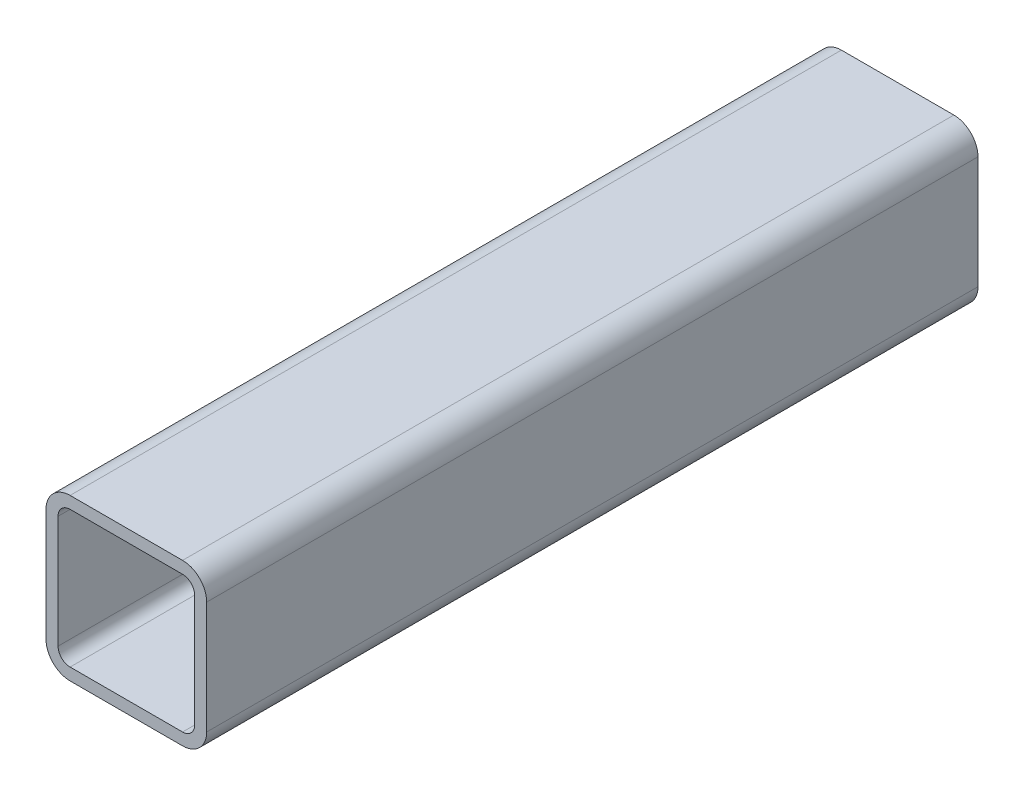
ISO-10303-21;
HEADER;
FILE_DESCRIPTION(('STEP AP214'),'2;1');
FILE_NAME('part.step','',(''),(''),'','','');
FILE_SCHEMA(('AUTOMOTIVE_DESIGN { 1 0 10303 214 1 1 1 1 }'));
ENDSEC;
DATA;
#1=APPLICATION_CONTEXT('core data for automotive mechanical design processes');
#2=APPLICATION_PROTOCOL_DEFINITION('international standard','automotive_design',2000,#1);
#3=PRODUCT_CONTEXT('',#1,'mechanical');
#4=PRODUCT('Part','Part','',(#3));
#5=PRODUCT_RELATED_PRODUCT_CATEGORY('part','',(#4));
#6=PRODUCT_DEFINITION_FORMATION('','',#4);
#7=PRODUCT_DEFINITION_CONTEXT('part definition',#1,'design');
#8=PRODUCT_DEFINITION('design','',#6,#7);
#9=PRODUCT_DEFINITION_SHAPE('','',#8);
#10=(LENGTH_UNIT() NAMED_UNIT(*) SI_UNIT(.MILLI.,.METRE.));
#11=(NAMED_UNIT(*) PLANE_ANGLE_UNIT() SI_UNIT($,.RADIAN.));
#12=(NAMED_UNIT(*) SI_UNIT($,.STERADIAN.) SOLID_ANGLE_UNIT());
#13=UNCERTAINTY_MEASURE_WITH_UNIT(LENGTH_MEASURE(1.E-05),#10,'distance_accuracy_value','');
#14=(GEOMETRIC_REPRESENTATION_CONTEXT(3) GLOBAL_UNCERTAINTY_ASSIGNED_CONTEXT((#13)) GLOBAL_UNIT_ASSIGNED_CONTEXT((#10,
#11,#12)) REPRESENTATION_CONTEXT('',''));
#15=CARTESIAN_POINT('',(0.,0.,0.));
#16=DIRECTION('',(0.,0.,1.));
#17=DIRECTION('',(1.,0.,0.));
#18=AXIS2_PLACEMENT_3D('',#15,#16,#17);
#19=CARTESIAN_POINT('',(12.4210851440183,54.799418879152,304.8));
#20=DIRECTION('',(0.,0.,1.));
#21=DIRECTION('',(1.,0.,0.));
#22=AXIS2_PLACEMENT_3D('',#19,#20,#21);
#23=PLANE('',#22);
#24=CARTESIAN_POINT('',(12.4210851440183,54.799418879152,304.8));
#25=DIRECTION('',(0.,0.,1.));
#26=DIRECTION('',(1.,0.,0.));
#27=AXIS2_PLACEMENT_3D('',#24,#25,#26);
#28=CIRCLE('',#27,9.52500000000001);
#29=CARTESIAN_POINT('',(12.4210851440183,64.324418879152,304.8));
#30=VERTEX_POINT('',#29);
#31=CARTESIAN_POINT('',(2.89608514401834,54.799418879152,304.8));
#32=VERTEX_POINT('',#31);
#33=EDGE_CURVE('E211',#30,#32,#28,.T.);
#34=ORIENTED_EDGE('',*,*,#33,.T.);
#35=DIRECTION('',(0.,-1.,0.));
#36=VECTOR('',#35,1.);
#37=CARTESIAN_POINT('',(2.89608514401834,10.349418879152,304.8));
#38=LINE('',#37,#36);
#39=CARTESIAN_POINT('',(2.89608514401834,10.349418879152,304.8));
#40=VERTEX_POINT('',#39);
#41=EDGE_CURVE('E214',#32,#40,#38,.T.);
#42=ORIENTED_EDGE('',*,*,#41,.T.);
#43=CARTESIAN_POINT('',(12.4210851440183,10.349418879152,304.8));
#44=DIRECTION('',(0.,0.,1.));
#45=DIRECTION('',(1.,0.,0.));
#46=AXIS2_PLACEMENT_3D('',#43,#44,#45);
#47=CIRCLE('',#46,9.525);
#48=CARTESIAN_POINT('',(12.4210851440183,0.824418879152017,304.8));
#49=VERTEX_POINT('',#48);
#50=EDGE_CURVE('E217',#40,#49,#47,.T.);
#51=ORIENTED_EDGE('',*,*,#50,.T.);
#52=DIRECTION('',(1.,0.,0.));
#53=VECTOR('',#52,1.);
#54=CARTESIAN_POINT('',(56.8710851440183,0.824418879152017,304.8));
#55=LINE('',#54,#53);
#56=CARTESIAN_POINT('',(56.8710851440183,0.824418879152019,304.8));
#57=VERTEX_POINT('',#56);
#58=EDGE_CURVE('E219',#49,#57,#55,.T.);
#59=ORIENTED_EDGE('',*,*,#58,.T.);
#60=CARTESIAN_POINT('',(56.8710851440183,10.349418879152,304.8));
#61=DIRECTION('',(0.,0.,1.));
#62=DIRECTION('',(1.,0.,0.));
#63=AXIS2_PLACEMENT_3D('',#60,#61,#62);
#64=CIRCLE('',#63,9.525);
#65=CARTESIAN_POINT('',(66.3960851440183,10.349418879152,304.8));
#66=VERTEX_POINT('',#65);
#67=EDGE_CURVE('E221',#57,#66,#64,.T.);
#68=ORIENTED_EDGE('',*,*,#67,.T.);
#69=DIRECTION('',(0.,1.,0.));
#70=VECTOR('',#69,1.);
#71=CARTESIAN_POINT('',(66.3960851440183,54.799418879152,304.8));
#72=LINE('',#71,#70);
#73=CARTESIAN_POINT('',(66.3960851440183,54.799418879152,304.8));
#74=VERTEX_POINT('',#73);
#75=EDGE_CURVE('E223',#66,#74,#72,.T.);
#76=ORIENTED_EDGE('',*,*,#75,.T.);
#77=CARTESIAN_POINT('',(56.8710851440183,54.799418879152,304.8));
#78=DIRECTION('',(0.,0.,1.));
#79=DIRECTION('',(1.,0.,0.));
#80=AXIS2_PLACEMENT_3D('',#77,#78,#79);
#81=CIRCLE('',#80,9.52500000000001);
#82=CARTESIAN_POINT('',(56.8710851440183,64.324418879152,304.8));
#83=VERTEX_POINT('',#82);
#84=EDGE_CURVE('E225',#74,#83,#81,.T.);
#85=ORIENTED_EDGE('',*,*,#84,.T.);
#86=DIRECTION('',(-1.,0.,0.));
#87=VECTOR('',#86,1.);
#88=CARTESIAN_POINT('',(12.4210851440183,64.324418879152,304.8));
#89=LINE('',#88,#87);
#90=EDGE_CURVE('E227',#83,#30,#89,.T.);
#91=ORIENTED_EDGE('',*,*,#90,.T.);
#92=EDGE_LOOP('',(#34,#42,#51,#59,#68,#76,#85,#91));
#93=FACE_BOUND('',#92,.T.);
#94=DIRECTION('',(0.,-1.,0.));
#95=VECTOR('',#94,1.);
#96=CARTESIAN_POINT('',(7.65858514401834,10.349418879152,304.8));
#97=LINE('',#96,#95);
#98=CARTESIAN_POINT('',(7.65858514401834,54.799418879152,304.8));
#99=VERTEX_POINT('',#98);
#100=CARTESIAN_POINT('',(7.65858514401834,10.349418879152,304.8));
#101=VERTEX_POINT('',#100);
#102=EDGE_CURVE('E154',#99,#101,#97,.T.);
#103=ORIENTED_EDGE('',*,*,#102,.F.);
#104=CARTESIAN_POINT('',(12.4210851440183,54.799418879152,304.8));
#105=DIRECTION('',(0.,0.,1.));
#106=DIRECTION('',(1.,0.,0.));
#107=AXIS2_PLACEMENT_3D('',#104,#105,#106);
#108=CIRCLE('',#107,4.7625);
#109=CARTESIAN_POINT('',(12.4210851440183,59.561918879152,304.8));
#110=VERTEX_POINT('',#109);
#111=EDGE_CURVE('E146',#110,#99,#108,.T.);
#112=ORIENTED_EDGE('',*,*,#111,.F.);
#113=DIRECTION('',(-1.,0.,0.));
#114=VECTOR('',#113,1.);
#115=CARTESIAN_POINT('',(12.4210851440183,59.561918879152,304.8));
#116=LINE('',#115,#114);
#117=CARTESIAN_POINT('',(56.8710851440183,59.561918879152,304.8));
#118=VERTEX_POINT('',#117);
#119=EDGE_CURVE('E179',#118,#110,#116,.T.);
#120=ORIENTED_EDGE('',*,*,#119,.F.);
#121=CARTESIAN_POINT('',(56.8710851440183,54.799418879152,304.8));
#122=DIRECTION('',(0.,0.,1.));
#123=DIRECTION('',(1.,0.,0.));
#124=AXIS2_PLACEMENT_3D('',#121,#122,#123);
#125=CIRCLE('',#124,4.76250000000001);
#126=CARTESIAN_POINT('',(61.6335851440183,54.799418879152,304.8));
#127=VERTEX_POINT('',#126);
#128=EDGE_CURVE('E177',#127,#118,#125,.T.);
#129=ORIENTED_EDGE('',*,*,#128,.F.);
#130=DIRECTION('',(0.,1.,0.));
#131=VECTOR('',#130,1.);
#132=CARTESIAN_POINT('',(61.6335851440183,54.799418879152,304.8));
#133=LINE('',#132,#131);
#134=CARTESIAN_POINT('',(61.6335851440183,10.349418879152,304.8));
#135=VERTEX_POINT('',#134);
#136=EDGE_CURVE('E175',#135,#127,#133,.T.);
#137=ORIENTED_EDGE('',*,*,#136,.F.);
#138=CARTESIAN_POINT('',(56.8710851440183,10.349418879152,304.8));
#139=DIRECTION('',(0.,0.,1.));
#140=DIRECTION('',(1.,0.,0.));
#141=AXIS2_PLACEMENT_3D('',#138,#139,#140);
#142=CIRCLE('',#141,4.7625);
#143=CARTESIAN_POINT('',(56.8710851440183,5.58691887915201,304.8));
#144=VERTEX_POINT('',#143);
#145=EDGE_CURVE('E173',#144,#135,#142,.T.);
#146=ORIENTED_EDGE('',*,*,#145,.F.);
#147=DIRECTION('',(1.,0.,0.));
#148=VECTOR('',#147,1.);
#149=CARTESIAN_POINT('',(56.8710851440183,5.58691887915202,304.8));
#150=LINE('',#149,#148);
#151=CARTESIAN_POINT('',(12.4210851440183,5.58691887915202,304.8));
#152=VERTEX_POINT('',#151);
#153=EDGE_CURVE('E169',#152,#144,#150,.T.);
#154=ORIENTED_EDGE('',*,*,#153,.F.);
#155=CARTESIAN_POINT('',(12.4210851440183,10.349418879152,304.8));
#156=DIRECTION('',(0.,0.,1.));
#157=DIRECTION('',(1.,0.,0.));
#158=AXIS2_PLACEMENT_3D('',#155,#156,#157);
#159=CIRCLE('',#158,4.7625);
#160=EDGE_CURVE('E167',#101,#152,#159,.T.);
#161=ORIENTED_EDGE('',*,*,#160,.F.);
#162=EDGE_LOOP('',(#103,#112,#120,#129,#137,#146,#154,#161));
#163=FACE_BOUND('',#162,.T.);
#164=ADVANCED_FACE('F33',(#93,#163),#23,.T.);
#165=CARTESIAN_POINT('',(12.4210851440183,54.799418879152,0.));
#166=DIRECTION('',(0.,0.,1.));
#167=DIRECTION('',(1.,0.,0.));
#168=AXIS2_PLACEMENT_3D('',#165,#166,#167);
#169=PLANE('',#168);
#170=CARTESIAN_POINT('',(12.4210851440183,54.799418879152,0.));
#171=DIRECTION('',(0.,0.,1.));
#172=DIRECTION('',(1.,0.,0.));
#173=AXIS2_PLACEMENT_3D('',#170,#171,#172);
#174=CIRCLE('',#173,9.52500000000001);
#175=CARTESIAN_POINT('',(12.4210851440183,64.324418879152,0.));
#176=VERTEX_POINT('',#175);
#177=CARTESIAN_POINT('',(2.89608514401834,54.799418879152,0.));
#178=VERTEX_POINT('',#177);
#179=EDGE_CURVE('E162',#176,#178,#174,.T.);
#180=ORIENTED_EDGE('',*,*,#179,.F.);
#181=DIRECTION('',(-1.,0.,0.));
#182=VECTOR('',#181,1.);
#183=CARTESIAN_POINT('',(12.4210851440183,64.324418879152,0.));
#184=LINE('',#183,#182);
#185=CARTESIAN_POINT('',(56.8710851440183,64.324418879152,0.));
#186=VERTEX_POINT('',#185);
#187=EDGE_CURVE('E215',#186,#176,#184,.T.);
#188=ORIENTED_EDGE('',*,*,#187,.F.);
#189=CARTESIAN_POINT('',(56.8710851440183,54.799418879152,0.));
#190=DIRECTION('',(0.,0.,1.));
#191=DIRECTION('',(1.,0.,0.));
#192=AXIS2_PLACEMENT_3D('',#189,#190,#191);
#193=CIRCLE('',#192,9.52500000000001);
#194=CARTESIAN_POINT('',(66.3960851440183,54.799418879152,0.));
#195=VERTEX_POINT('',#194);
#196=EDGE_CURVE('E242',#195,#186,#193,.T.);
#197=ORIENTED_EDGE('',*,*,#196,.F.);
#198=DIRECTION('',(0.,1.,0.));
#199=VECTOR('',#198,1.);
#200=CARTESIAN_POINT('',(66.3960851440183,54.799418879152,0.));
#201=LINE('',#200,#199);
#202=CARTESIAN_POINT('',(66.3960851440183,10.349418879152,0.));
#203=VERTEX_POINT('',#202);
#204=EDGE_CURVE('E240',#203,#195,#201,.T.);
#205=ORIENTED_EDGE('',*,*,#204,.F.);
#206=CARTESIAN_POINT('',(56.8710851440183,10.349418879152,0.));
#207=DIRECTION('',(0.,0.,1.));
#208=DIRECTION('',(1.,0.,0.));
#209=AXIS2_PLACEMENT_3D('',#206,#207,#208);
#210=CIRCLE('',#209,9.525);
#211=CARTESIAN_POINT('',(56.8710851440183,0.824418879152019,0.));
#212=VERTEX_POINT('',#211);
#213=EDGE_CURVE('E238',#212,#203,#210,.T.);
#214=ORIENTED_EDGE('',*,*,#213,.F.);
#215=DIRECTION('',(1.,0.,0.));
#216=VECTOR('',#215,1.);
#217=CARTESIAN_POINT('',(56.8710851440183,0.824418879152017,0.));
#218=LINE('',#217,#216);
#219=CARTESIAN_POINT('',(12.4210851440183,0.824418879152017,0.));
#220=VERTEX_POINT('',#219);
#221=EDGE_CURVE('E236',#220,#212,#218,.T.);
#222=ORIENTED_EDGE('',*,*,#221,.F.);
#223=CARTESIAN_POINT('',(12.4210851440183,10.349418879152,0.));
#224=DIRECTION('',(0.,0.,1.));
#225=DIRECTION('',(1.,0.,0.));
#226=AXIS2_PLACEMENT_3D('',#223,#224,#225);
#227=CIRCLE('',#226,9.525);
#228=CARTESIAN_POINT('',(2.89608514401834,10.349418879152,0.));
#229=VERTEX_POINT('',#228);
#230=EDGE_CURVE('E234',#229,#220,#227,.T.);
#231=ORIENTED_EDGE('',*,*,#230,.F.);
#232=DIRECTION('',(0.,-1.,0.));
#233=VECTOR('',#232,1.);
#234=CARTESIAN_POINT('',(2.89608514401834,10.349418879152,0.));
#235=LINE('',#234,#233);
#236=EDGE_CURVE('E232',#178,#229,#235,.T.);
#237=ORIENTED_EDGE('',*,*,#236,.F.);
#238=EDGE_LOOP('',(#180,#188,#197,#205,#214,#222,#231,#237));
#239=FACE_BOUND('',#238,.T.);
#240=CARTESIAN_POINT('',(12.4210851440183,54.799418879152,0.));
#241=DIRECTION('',(0.,0.,1.));
#242=DIRECTION('',(1.,0.,0.));
#243=AXIS2_PLACEMENT_3D('',#240,#241,#242);
#244=CIRCLE('',#243,4.7625);
#245=CARTESIAN_POINT('',(12.4210851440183,59.561918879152,0.));
#246=VERTEX_POINT('',#245);
#247=CARTESIAN_POINT('',(7.65858514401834,54.799418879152,0.));
#248=VERTEX_POINT('',#247);
#249=EDGE_CURVE('E56',#246,#248,#244,.T.);
#250=ORIENTED_EDGE('',*,*,#249,.T.);
#251=DIRECTION('',(0.,-1.,0.));
#252=VECTOR('',#251,1.);
#253=CARTESIAN_POINT('',(7.65858514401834,10.349418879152,0.));
#254=LINE('',#253,#252);
#255=CARTESIAN_POINT('',(7.65858514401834,10.349418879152,0.));
#256=VERTEX_POINT('',#255);
#257=EDGE_CURVE('E161',#248,#256,#254,.T.);
#258=ORIENTED_EDGE('',*,*,#257,.T.);
#259=CARTESIAN_POINT('',(12.4210851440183,10.349418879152,0.));
#260=DIRECTION('',(0.,0.,1.));
#261=DIRECTION('',(1.,0.,0.));
#262=AXIS2_PLACEMENT_3D('',#259,#260,#261);
#263=CIRCLE('',#262,4.7625);
#264=CARTESIAN_POINT('',(12.4210851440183,5.58691887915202,0.));
#265=VERTEX_POINT('',#264);
#266=EDGE_CURVE('E183',#256,#265,#263,.T.);
#267=ORIENTED_EDGE('',*,*,#266,.T.);
#268=DIRECTION('',(1.,0.,0.));
#269=VECTOR('',#268,1.);
#270=CARTESIAN_POINT('',(56.8710851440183,5.58691887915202,0.));
#271=LINE('',#270,#269);
#272=CARTESIAN_POINT('',(56.8710851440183,5.58691887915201,0.));
#273=VERTEX_POINT('',#272);
#274=EDGE_CURVE('E186',#265,#273,#271,.T.);
#275=ORIENTED_EDGE('',*,*,#274,.T.);
#276=CARTESIAN_POINT('',(56.8710851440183,10.349418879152,0.));
#277=DIRECTION('',(0.,0.,1.));
#278=DIRECTION('',(1.,0.,0.));
#279=AXIS2_PLACEMENT_3D('',#276,#277,#278);
#280=CIRCLE('',#279,4.7625);
#281=CARTESIAN_POINT('',(61.6335851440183,10.349418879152,0.));
#282=VERTEX_POINT('',#281);
#283=EDGE_CURVE('E189',#273,#282,#280,.T.);
#284=ORIENTED_EDGE('',*,*,#283,.T.);
#285=DIRECTION('',(0.,1.,0.));
#286=VECTOR('',#285,1.);
#287=CARTESIAN_POINT('',(61.6335851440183,54.799418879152,0.));
#288=LINE('',#287,#286);
#289=CARTESIAN_POINT('',(61.6335851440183,54.799418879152,0.));
#290=VERTEX_POINT('',#289);
#291=EDGE_CURVE('E192',#282,#290,#288,.T.);
#292=ORIENTED_EDGE('',*,*,#291,.T.);
#293=CARTESIAN_POINT('',(56.8710851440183,54.799418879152,0.));
#294=DIRECTION('',(0.,0.,1.));
#295=DIRECTION('',(1.,0.,0.));
#296=AXIS2_PLACEMENT_3D('',#293,#294,#295);
#297=CIRCLE('',#296,4.76250000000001);
#298=CARTESIAN_POINT('',(56.8710851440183,59.561918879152,0.));
#299=VERTEX_POINT('',#298);
#300=EDGE_CURVE('E195',#290,#299,#297,.T.);
#301=ORIENTED_EDGE('',*,*,#300,.T.);
#302=DIRECTION('',(-1.,0.,0.));
#303=VECTOR('',#302,1.);
#304=CARTESIAN_POINT('',(12.4210851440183,59.561918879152,0.));
#305=LINE('',#304,#303);
#306=EDGE_CURVE('E155',#299,#246,#305,.T.);
#307=ORIENTED_EDGE('',*,*,#306,.T.);
#308=EDGE_LOOP('',(#250,#258,#267,#275,#284,#292,#301,#307));
#309=FACE_BOUND('',#308,.T.);
#310=ADVANCED_FACE('F272',(#239,#309),#169,.F.);
#311=CARTESIAN_POINT('',(12.4210851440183,54.799418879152,304.8));
#312=DIRECTION('',(0.,0.,-1.));
#313=DIRECTION('',(-1.,0.,0.));
#314=AXIS2_PLACEMENT_3D('',#311,#312,#313);
#315=CYLINDRICAL_SURFACE('',#314,9.52500000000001);
#316=ORIENTED_EDGE('',*,*,#179,.T.);
#317=DIRECTION('',(0.,0.,-1.));
#318=VECTOR('',#317,1.);
#319=CARTESIAN_POINT('',(2.89608514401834,54.799418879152,304.8));
#320=LINE('',#319,#318);
#321=EDGE_CURVE('E11',#32,#178,#320,.T.);
#322=ORIENTED_EDGE('',*,*,#321,.F.);
#323=ORIENTED_EDGE('',*,*,#33,.F.);
#324=DIRECTION('',(0.,0.,-1.));
#325=VECTOR('',#324,1.);
#326=CARTESIAN_POINT('',(12.4210851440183,64.324418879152,304.8));
#327=LINE('',#326,#325);
#328=EDGE_CURVE('E229',#30,#176,#327,.T.);
#329=ORIENTED_EDGE('',*,*,#328,.T.);
#330=EDGE_LOOP('',(#316,#322,#323,#329));
#331=FACE_BOUND('',#330,.T.);
#332=ADVANCED_FACE('F35',(#331),#315,.T.);
#333=CARTESIAN_POINT('',(2.89608514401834,10.349418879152,304.8));
#334=DIRECTION('',(1.,0.,0.));
#335=DIRECTION('',(0.,0.,-1.));
#336=AXIS2_PLACEMENT_3D('',#333,#334,#335);
#337=PLANE('',#336);
#338=ORIENTED_EDGE('',*,*,#236,.T.);
#339=DIRECTION('',(0.,0.,-1.));
#340=VECTOR('',#339,1.);
#341=CARTESIAN_POINT('',(2.89608514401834,10.349418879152,304.8));
#342=LINE('',#341,#340);
#343=EDGE_CURVE('E41',#40,#229,#342,.T.);
#344=ORIENTED_EDGE('',*,*,#343,.F.);
#345=ORIENTED_EDGE('',*,*,#41,.F.);
#346=ORIENTED_EDGE('',*,*,#321,.T.);
#347=EDGE_LOOP('',(#338,#344,#345,#346));
#348=FACE_BOUND('',#347,.T.);
#349=ADVANCED_FACE('F289',(#348),#337,.F.);
#350=CARTESIAN_POINT('',(12.4210851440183,10.349418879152,304.8));
#351=DIRECTION('',(0.,0.,-1.));
#352=DIRECTION('',(-1.,0.,0.));
#353=AXIS2_PLACEMENT_3D('',#350,#351,#352);
#354=CYLINDRICAL_SURFACE('',#353,9.525);
#355=ORIENTED_EDGE('',*,*,#230,.T.);
#356=DIRECTION('',(0.,0.,-1.));
#357=VECTOR('',#356,1.);
#358=CARTESIAN_POINT('',(12.4210851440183,0.824418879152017,304.8));
#359=LINE('',#358,#357);
#360=EDGE_CURVE('E259',#49,#220,#359,.T.);
#361=ORIENTED_EDGE('',*,*,#360,.F.);
#362=ORIENTED_EDGE('',*,*,#50,.F.);
#363=ORIENTED_EDGE('',*,*,#343,.T.);
#364=EDGE_LOOP('',(#355,#361,#362,#363));
#365=FACE_BOUND('',#364,.T.);
#366=ADVANCED_FACE('F266',(#365),#354,.T.);
#367=CARTESIAN_POINT('',(56.8710851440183,0.824418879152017,304.8));
#368=DIRECTION('',(0.,1.,0.));
#369=DIRECTION('',(0.,0.,1.));
#370=AXIS2_PLACEMENT_3D('',#367,#368,#369);
#371=PLANE('',#370);
#372=ORIENTED_EDGE('',*,*,#221,.T.);
#373=DIRECTION('',(0.,0.,-1.));
#374=VECTOR('',#373,1.);
#375=CARTESIAN_POINT('',(56.8710851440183,0.824418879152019,304.8));
#376=LINE('',#375,#374);
#377=EDGE_CURVE('E256',#57,#212,#376,.T.);
#378=ORIENTED_EDGE('',*,*,#377,.F.);
#379=ORIENTED_EDGE('',*,*,#58,.F.);
#380=ORIENTED_EDGE('',*,*,#360,.T.);
#381=EDGE_LOOP('',(#372,#378,#379,#380));
#382=FACE_BOUND('',#381,.T.);
#383=ADVANCED_FACE('F278',(#382),#371,.F.);
#384=CARTESIAN_POINT('',(56.8710851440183,10.349418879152,304.8));
#385=DIRECTION('',(0.,0.,-1.));
#386=DIRECTION('',(-1.,0.,0.));
#387=AXIS2_PLACEMENT_3D('',#384,#385,#386);
#388=CYLINDRICAL_SURFACE('',#387,9.525);
#389=ORIENTED_EDGE('',*,*,#213,.T.);
#390=DIRECTION('',(0.,0.,-1.));
#391=VECTOR('',#390,1.);
#392=CARTESIAN_POINT('',(66.3960851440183,10.349418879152,304.8));
#393=LINE('',#392,#391);
#394=EDGE_CURVE('E253',#66,#203,#393,.T.);
#395=ORIENTED_EDGE('',*,*,#394,.F.);
#396=ORIENTED_EDGE('',*,*,#67,.F.);
#397=ORIENTED_EDGE('',*,*,#377,.T.);
#398=EDGE_LOOP('',(#389,#395,#396,#397));
#399=FACE_BOUND('',#398,.T.);
#400=ADVANCED_FACE('F282',(#399),#388,.T.);
#401=CARTESIAN_POINT('',(66.3960851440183,54.799418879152,304.8));
#402=DIRECTION('',(-1.,0.,0.));
#403=DIRECTION('',(0.,0.,1.));
#404=AXIS2_PLACEMENT_3D('',#401,#402,#403);
#405=PLANE('',#404);
#406=ORIENTED_EDGE('',*,*,#204,.T.);
#407=DIRECTION('',(0.,0.,-1.));
#408=VECTOR('',#407,1.);
#409=CARTESIAN_POINT('',(66.3960851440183,54.799418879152,304.8));
#410=LINE('',#409,#408);
#411=EDGE_CURVE('E250',#74,#195,#410,.T.);
#412=ORIENTED_EDGE('',*,*,#411,.F.);
#413=ORIENTED_EDGE('',*,*,#75,.F.);
#414=ORIENTED_EDGE('',*,*,#394,.T.);
#415=EDGE_LOOP('',(#406,#412,#413,#414));
#416=FACE_BOUND('',#415,.T.);
#417=ADVANCED_FACE('F302',(#416),#405,.F.);
#418=CARTESIAN_POINT('',(56.8710851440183,54.799418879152,304.8));
#419=DIRECTION('',(0.,0.,-1.));
#420=DIRECTION('',(-1.,0.,0.));
#421=AXIS2_PLACEMENT_3D('',#418,#419,#420);
#422=CYLINDRICAL_SURFACE('',#421,9.52500000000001);
#423=ORIENTED_EDGE('',*,*,#196,.T.);
#424=DIRECTION('',(0.,0.,-1.));
#425=VECTOR('',#424,1.);
#426=CARTESIAN_POINT('',(56.8710851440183,64.324418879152,304.8));
#427=LINE('',#426,#425);
#428=EDGE_CURVE('E247',#83,#186,#427,.T.);
#429=ORIENTED_EDGE('',*,*,#428,.F.);
#430=ORIENTED_EDGE('',*,*,#84,.F.);
#431=ORIENTED_EDGE('',*,*,#411,.T.);
#432=EDGE_LOOP('',(#423,#429,#430,#431));
#433=FACE_BOUND('',#432,.T.);
#434=ADVANCED_FACE('F300',(#433),#422,.T.);
#435=CARTESIAN_POINT('',(12.4210851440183,64.324418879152,304.8));
#436=DIRECTION('',(0.,-1.,0.));
#437=DIRECTION('',(0.,0.,-1.));
#438=AXIS2_PLACEMENT_3D('',#435,#436,#437);
#439=PLANE('',#438);
#440=ORIENTED_EDGE('',*,*,#187,.T.);
#441=ORIENTED_EDGE('',*,*,#328,.F.);
#442=ORIENTED_EDGE('',*,*,#90,.F.);
#443=ORIENTED_EDGE('',*,*,#428,.T.);
#444=EDGE_LOOP('',(#440,#441,#442,#443));
#445=FACE_BOUND('',#444,.T.);
#446=ADVANCED_FACE('F295',(#445),#439,.F.);
#447=CARTESIAN_POINT('',(12.4210851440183,54.799418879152,304.8));
#448=DIRECTION('',(0.,0.,-1.));
#449=DIRECTION('',(-1.,0.,0.));
#450=AXIS2_PLACEMENT_3D('',#447,#448,#449);
#451=CYLINDRICAL_SURFACE('',#450,4.7625);
#452=ORIENTED_EDGE('',*,*,#249,.F.);
#453=DIRECTION('',(0.,0.,-1.));
#454=VECTOR('',#453,1.);
#455=CARTESIAN_POINT('',(12.4210851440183,59.561918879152,304.8));
#456=LINE('',#455,#454);
#457=EDGE_CURVE('E150',#110,#246,#456,.T.);
#458=ORIENTED_EDGE('',*,*,#457,.F.);
#459=ORIENTED_EDGE('',*,*,#111,.T.);
#460=DIRECTION('',(0.,0.,-1.));
#461=VECTOR('',#460,1.);
#462=CARTESIAN_POINT('',(7.65858514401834,54.799418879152,304.8));
#463=LINE('',#462,#461);
#464=EDGE_CURVE('E149',#99,#248,#463,.T.);
#465=ORIENTED_EDGE('',*,*,#464,.T.);
#466=EDGE_LOOP('',(#452,#458,#459,#465));
#467=FACE_BOUND('',#466,.T.);
#468=ADVANCED_FACE('F148',(#467),#451,.F.);
#469=CARTESIAN_POINT('',(7.65858514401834,10.349418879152,304.8));
#470=DIRECTION('',(1.,0.,0.));
#471=DIRECTION('',(0.,0.,-1.));
#472=AXIS2_PLACEMENT_3D('',#469,#470,#471);
#473=PLANE('',#472);
#474=ORIENTED_EDGE('',*,*,#257,.F.);
#475=ORIENTED_EDGE('',*,*,#464,.F.);
#476=ORIENTED_EDGE('',*,*,#102,.T.);
#477=DIRECTION('',(0.,0.,-1.));
#478=VECTOR('',#477,1.);
#479=CARTESIAN_POINT('',(7.65858514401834,10.349418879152,304.8));
#480=LINE('',#479,#478);
#481=EDGE_CURVE('E163',#101,#256,#480,.T.);
#482=ORIENTED_EDGE('',*,*,#481,.T.);
#483=EDGE_LOOP('',(#474,#475,#476,#482));
#484=FACE_BOUND('',#483,.T.);
#485=ADVANCED_FACE('F158',(#484),#473,.T.);
#486=CARTESIAN_POINT('',(12.4210851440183,10.349418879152,304.8));
#487=DIRECTION('',(0.,0.,-1.));
#488=DIRECTION('',(-1.,0.,0.));
#489=AXIS2_PLACEMENT_3D('',#486,#487,#488);
#490=CYLINDRICAL_SURFACE('',#489,4.7625);
#491=ORIENTED_EDGE('',*,*,#266,.F.);
#492=ORIENTED_EDGE('',*,*,#481,.F.);
#493=ORIENTED_EDGE('',*,*,#160,.T.);
#494=DIRECTION('',(0.,0.,-1.));
#495=VECTOR('',#494,1.);
#496=CARTESIAN_POINT('',(12.4210851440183,5.58691887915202,304.8));
#497=LINE('',#496,#495);
#498=EDGE_CURVE('E208',#152,#265,#497,.T.);
#499=ORIENTED_EDGE('',*,*,#498,.T.);
#500=EDGE_LOOP('',(#491,#492,#493,#499));
#501=FACE_BOUND('',#500,.T.);
#502=ADVANCED_FACE('F327',(#501),#490,.F.);
#503=CARTESIAN_POINT('',(56.8710851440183,5.58691887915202,304.8));
#504=DIRECTION('',(0.,1.,0.));
#505=DIRECTION('',(0.,0.,1.));
#506=AXIS2_PLACEMENT_3D('',#503,#504,#505);
#507=PLANE('',#506);
#508=ORIENTED_EDGE('',*,*,#274,.F.);
#509=ORIENTED_EDGE('',*,*,#498,.F.);
#510=ORIENTED_EDGE('',*,*,#153,.T.);
#511=DIRECTION('',(0.,0.,-1.));
#512=VECTOR('',#511,1.);
#513=CARTESIAN_POINT('',(56.8710851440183,5.58691887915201,304.8));
#514=LINE('',#513,#512);
#515=EDGE_CURVE('E206',#144,#273,#514,.T.);
#516=ORIENTED_EDGE('',*,*,#515,.T.);
#517=EDGE_LOOP('',(#508,#509,#510,#516));
#518=FACE_BOUND('',#517,.T.);
#519=ADVANCED_FACE('F331',(#518),#507,.T.);
#520=CARTESIAN_POINT('',(56.8710851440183,10.349418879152,304.8));
#521=DIRECTION('',(0.,0.,-1.));
#522=DIRECTION('',(-1.,0.,0.));
#523=AXIS2_PLACEMENT_3D('',#520,#521,#522);
#524=CYLINDRICAL_SURFACE('',#523,4.7625);
#525=ORIENTED_EDGE('',*,*,#283,.F.);
#526=ORIENTED_EDGE('',*,*,#515,.F.);
#527=ORIENTED_EDGE('',*,*,#145,.T.);
#528=DIRECTION('',(0.,0.,-1.));
#529=VECTOR('',#528,1.);
#530=CARTESIAN_POINT('',(61.6335851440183,10.349418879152,304.8));
#531=LINE('',#530,#529);
#532=EDGE_CURVE('E204',#135,#282,#531,.T.);
#533=ORIENTED_EDGE('',*,*,#532,.T.);
#534=EDGE_LOOP('',(#525,#526,#527,#533));
#535=FACE_BOUND('',#534,.T.);
#536=ADVANCED_FACE('F337',(#535),#524,.F.);
#537=CARTESIAN_POINT('',(61.6335851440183,54.799418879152,304.8));
#538=DIRECTION('',(-1.,0.,0.));
#539=DIRECTION('',(0.,0.,1.));
#540=AXIS2_PLACEMENT_3D('',#537,#538,#539);
#541=PLANE('',#540);
#542=ORIENTED_EDGE('',*,*,#291,.F.);
#543=ORIENTED_EDGE('',*,*,#532,.F.);
#544=ORIENTED_EDGE('',*,*,#136,.T.);
#545=DIRECTION('',(0.,0.,-1.));
#546=VECTOR('',#545,1.);
#547=CARTESIAN_POINT('',(61.6335851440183,54.799418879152,304.8));
#548=LINE('',#547,#546);
#549=EDGE_CURVE('E202',#127,#290,#548,.T.);
#550=ORIENTED_EDGE('',*,*,#549,.T.);
#551=EDGE_LOOP('',(#542,#543,#544,#550));
#552=FACE_BOUND('',#551,.T.);
#553=ADVANCED_FACE('F341',(#552),#541,.T.);
#554=CARTESIAN_POINT('',(56.8710851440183,54.799418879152,304.8));
#555=DIRECTION('',(0.,0.,-1.));
#556=DIRECTION('',(-1.,0.,0.));
#557=AXIS2_PLACEMENT_3D('',#554,#555,#556);
#558=CYLINDRICAL_SURFACE('',#557,4.76250000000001);
#559=ORIENTED_EDGE('',*,*,#300,.F.);
#560=ORIENTED_EDGE('',*,*,#549,.F.);
#561=ORIENTED_EDGE('',*,*,#128,.T.);
#562=DIRECTION('',(0.,0.,-1.));
#563=VECTOR('',#562,1.);
#564=CARTESIAN_POINT('',(56.8710851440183,59.561918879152,304.8));
#565=LINE('',#564,#563);
#566=EDGE_CURVE('E48',#118,#299,#565,.T.);
#567=ORIENTED_EDGE('',*,*,#566,.T.);
#568=EDGE_LOOP('',(#559,#560,#561,#567));
#569=FACE_BOUND('',#568,.T.);
#570=ADVANCED_FACE('F345',(#569),#558,.F.);
#571=CARTESIAN_POINT('',(12.4210851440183,59.561918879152,304.8));
#572=DIRECTION('',(0.,-1.,0.));
#573=DIRECTION('',(0.,0.,-1.));
#574=AXIS2_PLACEMENT_3D('',#571,#572,#573);
#575=PLANE('',#574);
#576=ORIENTED_EDGE('',*,*,#306,.F.);
#577=ORIENTED_EDGE('',*,*,#566,.F.);
#578=ORIENTED_EDGE('',*,*,#119,.T.);
#579=ORIENTED_EDGE('',*,*,#457,.T.);
#580=EDGE_LOOP('',(#576,#577,#578,#579));
#581=FACE_BOUND('',#580,.T.);
#582=ADVANCED_FACE('F349',(#581),#575,.T.);
#583=CLOSED_SHELL('',(#164,#310,#332,#349,#366,#383,#400,#417,#434,#446,#468,#485,#502,#519,
#536,#553,#570,#582));
#584=MANIFOLD_SOLID_BREP('B2',#583);
#585=ADVANCED_BREP_SHAPE_REPRESENTATION('',(#18,#584),#14);
#586=SHAPE_DEFINITION_REPRESENTATION(#9,#585);
ENDSEC;
END-ISO-10303-21;
